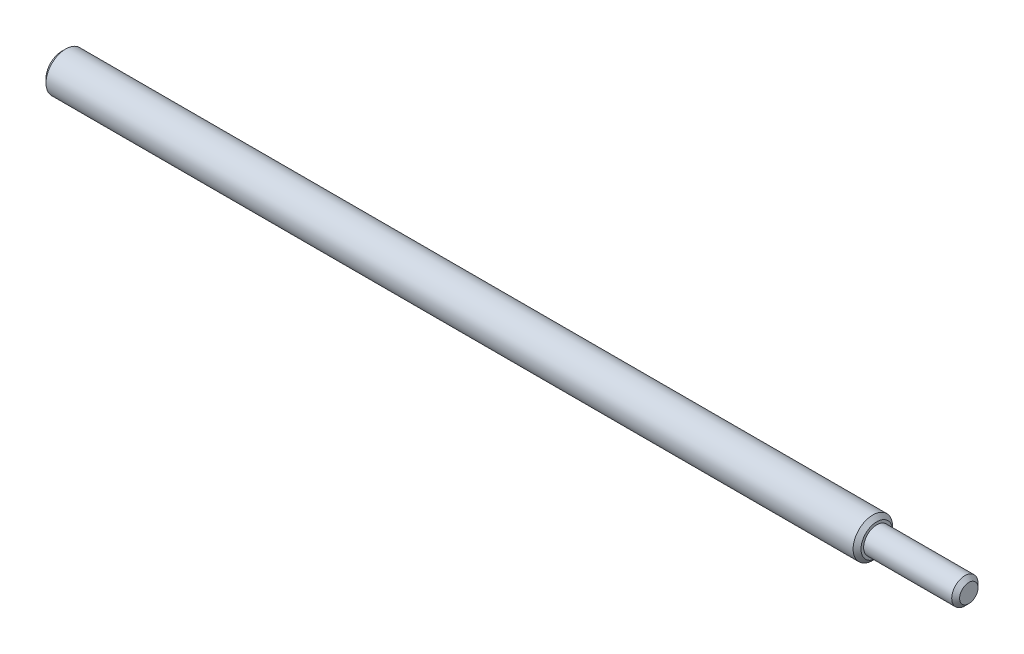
ISO-10303-21;
HEADER;
FILE_DESCRIPTION(('STEP AP214'),'2;1');
FILE_NAME('part.step','',(''),(''),'','','');
FILE_SCHEMA(('AUTOMOTIVE_DESIGN { 1 0 10303 214 1 1 1 1 }'));
ENDSEC;
DATA;
#1=APPLICATION_CONTEXT('core data for automotive mechanical design processes');
#2=APPLICATION_PROTOCOL_DEFINITION('international standard','automotive_design',2000,#1);
#3=PRODUCT_CONTEXT('',#1,'mechanical');
#4=PRODUCT('Part','Part','',(#3));
#5=PRODUCT_RELATED_PRODUCT_CATEGORY('part','',(#4));
#6=PRODUCT_DEFINITION_FORMATION('','',#4);
#7=PRODUCT_DEFINITION_CONTEXT('part definition',#1,'design');
#8=PRODUCT_DEFINITION('design','',#6,#7);
#9=PRODUCT_DEFINITION_SHAPE('','',#8);
#10=(LENGTH_UNIT() NAMED_UNIT(*) SI_UNIT(.MILLI.,.METRE.));
#11=(NAMED_UNIT(*) PLANE_ANGLE_UNIT() SI_UNIT($,.RADIAN.));
#12=(NAMED_UNIT(*) SI_UNIT($,.STERADIAN.) SOLID_ANGLE_UNIT());
#13=UNCERTAINTY_MEASURE_WITH_UNIT(LENGTH_MEASURE(1.E-05),#10,'distance_accuracy_value','');
#14=(GEOMETRIC_REPRESENTATION_CONTEXT(3) GLOBAL_UNCERTAINTY_ASSIGNED_CONTEXT((#13)) GLOBAL_UNIT_ASSIGNED_CONTEXT((#10,
#11,#12)) REPRESENTATION_CONTEXT('',''));
#15=CARTESIAN_POINT('',(0.,0.,0.));
#16=DIRECTION('',(0.,0.,1.));
#17=DIRECTION('',(1.,0.,0.));
#18=AXIS2_PLACEMENT_3D('',#15,#16,#17);
#19=CARTESIAN_POINT('',(0.,0.,0.));
#20=DIRECTION('',(1.,0.,0.));
#21=DIRECTION('',(0.,0.,-1.));
#22=AXIS2_PLACEMENT_3D('',#19,#20,#21);
#23=PLANE('',#22);
#24=CARTESIAN_POINT('',(0.,0.,0.));
#25=DIRECTION('',(1.,0.,0.));
#26=DIRECTION('',(0.,0.,-1.));
#27=AXIS2_PLACEMENT_3D('',#24,#25,#26);
#28=CIRCLE('',#27,2.39999999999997);
#29=CARTESIAN_POINT('',(0.,0.,-2.39999999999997));
#30=VERTEX_POINT('',#29);
#31=EDGE_CURVE('E41',#30,#30,#28,.F.);
#32=ORIENTED_EDGE('',*,*,#31,.T.);
#33=EDGE_LOOP('',(#32));
#34=FACE_BOUND('',#33,.T.);
#35=ADVANCED_FACE('F30',(#34),#23,.F.);
#36=CARTESIAN_POINT('',(0.,0.,0.));
#37=DIRECTION('',(-1.,0.,0.));
#38=DIRECTION('',(0.,0.,1.));
#39=AXIS2_PLACEMENT_3D('',#36,#37,#38);
#40=CYLINDRICAL_SURFACE('',#39,3.);
#41=CARTESIAN_POINT('',(123.4,0.,0.));
#42=DIRECTION('',(-1.,0.,0.));
#43=DIRECTION('',(0.,0.,1.));
#44=AXIS2_PLACEMENT_3D('',#41,#42,#43);
#45=CIRCLE('',#44,3.);
#46=CARTESIAN_POINT('',(123.4,0.,3.));
#47=VERTEX_POINT('',#46);
#48=EDGE_CURVE('E50',#47,#47,#45,.T.);
#49=ORIENTED_EDGE('',*,*,#48,.T.);
#50=EDGE_LOOP('',(#49));
#51=FACE_BOUND('',#50,.T.);
#52=CARTESIAN_POINT('',(0.600000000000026,0.,0.));
#53=DIRECTION('',(1.,0.,0.));
#54=DIRECTION('',(0.,0.,-1.));
#55=AXIS2_PLACEMENT_3D('',#52,#53,#54);
#56=CIRCLE('',#55,3.);
#57=CARTESIAN_POINT('',(0.600000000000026,0.,-3.));
#58=VERTEX_POINT('',#57);
#59=EDGE_CURVE('E53',#58,#58,#56,.T.);
#60=ORIENTED_EDGE('',*,*,#59,.T.);
#61=EDGE_LOOP('',(#60));
#62=FACE_BOUND('',#61,.T.);
#63=ADVANCED_FACE('F72',(#51,#62),#40,.T.);
#64=CARTESIAN_POINT('',(124.,3.,0.));
#65=DIRECTION('',(-1.,0.,0.));
#66=DIRECTION('',(0.,0.,1.));
#67=AXIS2_PLACEMENT_3D('',#64,#65,#66);
#68=PLANE('',#67);
#69=CARTESIAN_POINT('',(124.,0.,0.));
#70=DIRECTION('',(-1.,0.,0.));
#71=DIRECTION('',(0.,0.,1.));
#72=AXIS2_PLACEMENT_3D('',#69,#70,#71);
#73=CIRCLE('',#72,2.4);
#74=CARTESIAN_POINT('',(124.,0.,2.4));
#75=VERTEX_POINT('',#74);
#76=EDGE_CURVE('E45',#75,#75,#73,.F.);
#77=ORIENTED_EDGE('',*,*,#76,.T.);
#78=EDGE_LOOP('',(#77));
#79=FACE_BOUND('',#78,.T.);
#80=CARTESIAN_POINT('',(124.,0.,0.));
#81=DIRECTION('',(-1.,0.,0.));
#82=DIRECTION('',(0.,0.,1.));
#83=AXIS2_PLACEMENT_3D('',#80,#81,#82);
#84=CIRCLE('',#83,2.);
#85=CARTESIAN_POINT('',(124.,0.,2.));
#86=VERTEX_POINT('',#85);
#87=EDGE_CURVE('E56',#86,#86,#84,.T.);
#88=ORIENTED_EDGE('',*,*,#87,.T.);
#89=EDGE_LOOP('',(#88));
#90=FACE_BOUND('',#89,.T.);
#91=ADVANCED_FACE('F60',(#79,#90),#68,.F.);
#92=CARTESIAN_POINT('',(0.,0.,0.));
#93=DIRECTION('',(-1.,0.,0.));
#94=DIRECTION('',(0.,0.,1.));
#95=AXIS2_PLACEMENT_3D('',#92,#93,#94);
#96=CYLINDRICAL_SURFACE('',#95,2.);
#97=CARTESIAN_POINT('',(137.4,0.,0.));
#98=DIRECTION('',(-1.,0.,0.));
#99=DIRECTION('',(0.,0.,1.));
#100=AXIS2_PLACEMENT_3D('',#97,#98,#99);
#101=CIRCLE('',#100,2.);
#102=CARTESIAN_POINT('',(137.4,0.,2.));
#103=VERTEX_POINT('',#102);
#104=EDGE_CURVE('E37',#103,#103,#101,.T.);
#105=ORIENTED_EDGE('',*,*,#104,.T.);
#106=EDGE_LOOP('',(#105));
#107=FACE_BOUND('',#106,.T.);
#108=ORIENTED_EDGE('',*,*,#87,.F.);
#109=EDGE_LOOP('',(#108));
#110=FACE_BOUND('',#109,.T.);
#111=ADVANCED_FACE('F62',(#107,#110),#96,.T.);
#112=CARTESIAN_POINT('',(138.,2.,0.));
#113=DIRECTION('',(-1.,0.,0.));
#114=DIRECTION('',(0.,0.,1.));
#115=AXIS2_PLACEMENT_3D('',#112,#113,#114);
#116=PLANE('',#115);
#117=CARTESIAN_POINT('',(138.,0.,0.));
#118=DIRECTION('',(-1.,0.,0.));
#119=DIRECTION('',(0.,0.,1.));
#120=AXIS2_PLACEMENT_3D('',#117,#118,#119);
#121=CIRCLE('',#120,1.40000000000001);
#122=CARTESIAN_POINT('',(138.,0.,1.40000000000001));
#123=VERTEX_POINT('',#122);
#124=EDGE_CURVE('E10',#123,#123,#121,.F.);
#125=ORIENTED_EDGE('',*,*,#124,.T.);
#126=EDGE_LOOP('',(#125));
#127=FACE_BOUND('',#126,.T.);
#128=ADVANCED_FACE('F64',(#127),#116,.F.);
#129=CARTESIAN_POINT('',(123.4,0.,0.));
#130=DIRECTION('',(-1.,0.,0.));
#131=DIRECTION('',(0.,0.,1.));
#132=AXIS2_PLACEMENT_3D('',#129,#130,#131);
#133=CONICAL_SURFACE('',#132,3.,0.785398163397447);
#134=ORIENTED_EDGE('',*,*,#76,.F.);
#135=EDGE_LOOP('',(#134));
#136=FACE_BOUND('',#135,.T.);
#137=ORIENTED_EDGE('',*,*,#48,.F.);
#138=EDGE_LOOP('',(#137));
#139=FACE_BOUND('',#138,.T.);
#140=ADVANCED_FACE('F70',(#136,#139),#133,.T.);
#141=CARTESIAN_POINT('',(0.,0.,0.));
#142=DIRECTION('',(1.,0.,0.));
#143=DIRECTION('',(0.,0.,-1.));
#144=AXIS2_PLACEMENT_3D('',#141,#142,#143);
#145=CONICAL_SURFACE('',#144,2.39999999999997,0.78539816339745);
#146=ORIENTED_EDGE('',*,*,#59,.F.);
#147=EDGE_LOOP('',(#146));
#148=FACE_BOUND('',#147,.T.);
#149=ORIENTED_EDGE('',*,*,#31,.F.);
#150=EDGE_LOOP('',(#149));
#151=FACE_BOUND('',#150,.T.);
#152=ADVANCED_FACE('F85',(#148,#151),#145,.T.);
#153=CARTESIAN_POINT('',(137.4,0.,0.));
#154=DIRECTION('',(-1.,0.,0.));
#155=DIRECTION('',(0.,0.,1.));
#156=AXIS2_PLACEMENT_3D('',#153,#154,#155);
#157=CONICAL_SURFACE('',#156,2.,0.785398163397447);
#158=ORIENTED_EDGE('',*,*,#124,.F.);
#159=EDGE_LOOP('',(#158));
#160=FACE_BOUND('',#159,.T.);
#161=ORIENTED_EDGE('',*,*,#104,.F.);
#162=EDGE_LOOP('',(#161));
#163=FACE_BOUND('',#162,.T.);
#164=ADVANCED_FACE('F32',(#160,#163),#157,.T.);
#165=CLOSED_SHELL('',(#35,#63,#91,#111,#128,#140,#152,#164));
#166=MANIFOLD_SOLID_BREP('B2',#165);
#167=ADVANCED_BREP_SHAPE_REPRESENTATION('',(#18,#166),#14);
#168=SHAPE_DEFINITION_REPRESENTATION(#9,#167);
ENDSEC;
END-ISO-10303-21;
